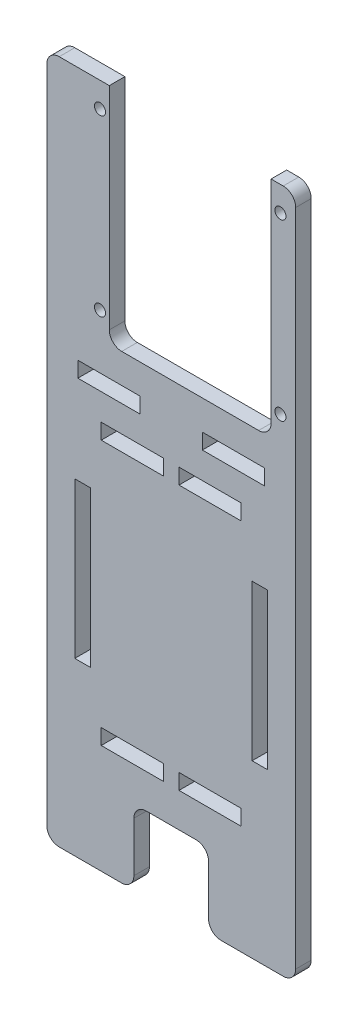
from build123d import *

# Parameters (mm, degrees)
SKETCH1_W             = 50.8
SKETCH1_H             = 139.7
BOSS_EXTRUDE1_DEPTH   = 3.175
SKETCH3_W             = 15.24
SKETCH3_H             = 38.1
CUT_EXTRUDE2_DEPTH    = 75.392628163
SKETCH22_W            = 33.02
SKETCH22_H            = 45.72
CUT_EXTRUDE8_DEPTH    = 75.392628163
F_2_CLEARANCE_HOLE1_D = 2.2606
FILLET1_R             = 2.54
SKETCH26_W            = 3.175
SKETCH26_H            = 31.75
SKETCH26_W_2          = 12.7
SKETCH26_H_2          = 3.175
CUT_EXTRUDE9_DEPTH    = 75.392628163
SKETCH27_W            = 12.7
SKETCH27_H            = 3.175
CUT_EXTRUDE10_DEPTH   = 75.392628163


with BuildPart() as part:
    # Sketch1 → Boss-Extrude1 (new body)
    with BuildSketch(Plane.XY):
        Rectangle(SKETCH1_W, SKETCH1_H)
    extrude(amount=BOSS_EXTRUDE1_DEPTH)

    # Sketch3 → Cut-Extrude2 (cut, through all)
    with BuildSketch(Plane.XY.offset(3.175)):
        with Locations((0, -73.66)):
            Rectangle(SKETCH3_W, SKETCH3_H)
    extrude(amount=-CUT_EXTRUDE2_DEPTH, mode=Mode.SUBTRACT)

    # Sketch22 → Cut-Extrude8 (cut, through all)
    with BuildSketch(Plane.XY.offset(3.175)):
        with Locations((3.872499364, 46.99)):
            Rectangle(SKETCH22_W, SKETCH22_H)
    extrude(amount=-CUT_EXTRUDE8_DEPTH, mode=Mode.SUBTRACT)

    # 2 Clearance Hole1 (through all)
    with Locations(Plane.XY.offset(3.175)):
        with Locations((22.287499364, 29.21), (-14.542500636, 64.77), (-14.542500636, 29.21), (22.287499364, 64.77)):
            Hole(F_2_CLEARANCE_HOLE1_D / 2)

    # Fillet1
    fillet1_edges = [part.edges().sort_by_distance(p)[0] for p in [
        (7.62, -69.85, 1.5875),
        (7.62, -54.61, 1.5875),
        (-7.62, -69.85, 1.5875),
        (-7.62, -54.61, 1.5875),
        (20.382499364, 24.13, 1.5875),
        (-12.637500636, 24.13, 1.5875),
        (25.4, -69.85, 1.5875),
        (-25.4, -69.85, 1.5875),
        (-25.4, 69.85, 1.5875),
        (25.4, 69.85, 1.5875),
    ]]
    fillet(fillet1_edges, radius=FILLET1_R)

    # Sketch26 → Cut-Extrude9 (cut, through all)
    with BuildSketch(Plane.XY.offset(3.175)):
        with Locations((18.0975, -19.05)):
            Rectangle(SKETCH26_W, SKETCH26_H)
        with Locations((7.9375, -46.0375)):
            Rectangle(SKETCH26_W_2, SKETCH26_H_2)
        with Locations((-18.0975, -19.05)):
            Rectangle(SKETCH26_W, SKETCH26_H)
        with Locations((-7.9375, -46.0375)):
            Rectangle(SKETCH26_W_2, SKETCH26_H_2)
        with Locations((-7.9375, 7.9375)):
            Rectangle(SKETCH26_W_2, SKETCH26_H_2)
        with Locations((7.9375, 7.9375)):
            Rectangle(SKETCH26_W_2, SKETCH26_H_2)
    extrude(amount=-CUT_EXTRUDE9_DEPTH, mode=Mode.SUBTRACT)

    # Sketch27 → Cut-Extrude10 (cut, through all)
    with BuildSketch(Plane.XY.offset(3.175)):
        with Locations((12.7, 16.51)):
            Rectangle(SKETCH27_W, SKETCH27_H)
        with Locations((-12.7, 16.51)):
            Rectangle(SKETCH27_W, SKETCH27_H)
    extrude(amount=-CUT_EXTRUDE10_DEPTH, mode=Mode.SUBTRACT)


solid = part.part
